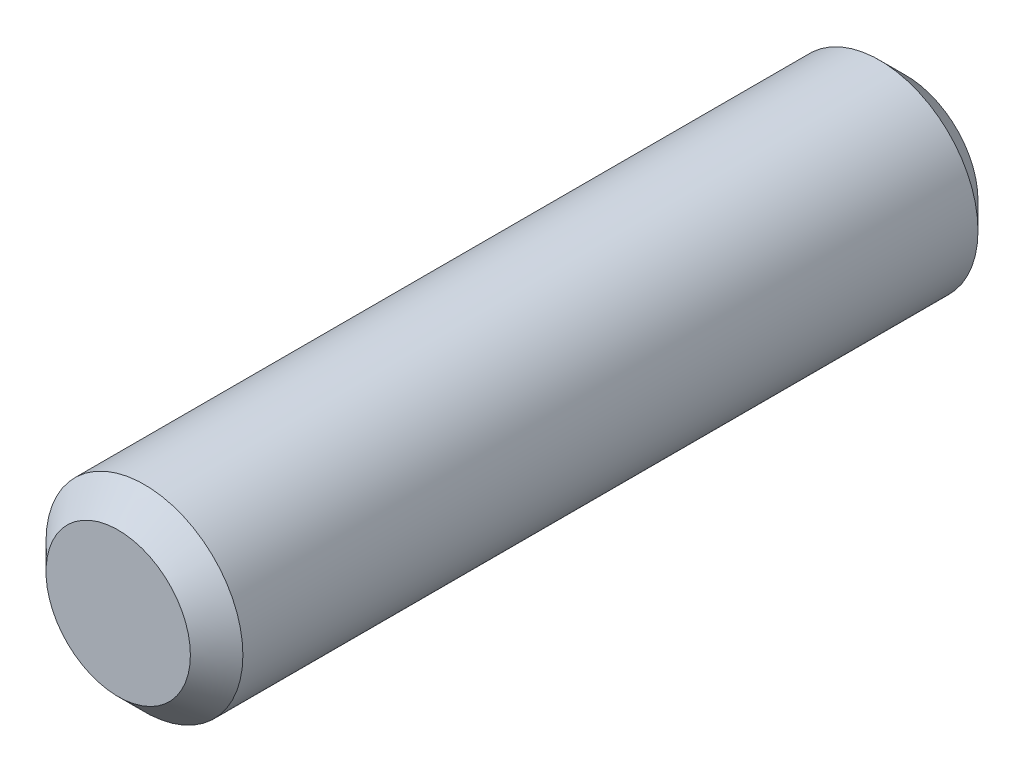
ISO-10303-21;
HEADER;
FILE_DESCRIPTION(('STEP AP214'),'2;1');
FILE_NAME('part.step','',(''),(''),'','','');
FILE_SCHEMA(('AUTOMOTIVE_DESIGN { 1 0 10303 214 1 1 1 1 }'));
ENDSEC;
DATA;
#1=APPLICATION_CONTEXT('core data for automotive mechanical design processes');
#2=APPLICATION_PROTOCOL_DEFINITION('international standard','automotive_design',2000,#1);
#3=PRODUCT_CONTEXT('',#1,'mechanical');
#4=PRODUCT('Part','Part','',(#3));
#5=PRODUCT_RELATED_PRODUCT_CATEGORY('part','',(#4));
#6=PRODUCT_DEFINITION_FORMATION('','',#4);
#7=PRODUCT_DEFINITION_CONTEXT('part definition',#1,'design');
#8=PRODUCT_DEFINITION('design','',#6,#7);
#9=PRODUCT_DEFINITION_SHAPE('','',#8);
#10=(LENGTH_UNIT() NAMED_UNIT(*) SI_UNIT(.MILLI.,.METRE.));
#11=(NAMED_UNIT(*) PLANE_ANGLE_UNIT() SI_UNIT($,.RADIAN.));
#12=(NAMED_UNIT(*) SI_UNIT($,.STERADIAN.) SOLID_ANGLE_UNIT());
#13=UNCERTAINTY_MEASURE_WITH_UNIT(LENGTH_MEASURE(1.E-05),#10,'distance_accuracy_value','');
#14=(GEOMETRIC_REPRESENTATION_CONTEXT(3) GLOBAL_UNCERTAINTY_ASSIGNED_CONTEXT((#13)) GLOBAL_UNIT_ASSIGNED_CONTEXT((#10,
#11,#12)) REPRESENTATION_CONTEXT('',''));
#15=CARTESIAN_POINT('',(0.,0.,0.));
#16=DIRECTION('',(0.,0.,1.));
#17=DIRECTION('',(1.,0.,0.));
#18=AXIS2_PLACEMENT_3D('',#15,#16,#17);
#19=CARTESIAN_POINT('',(0.,0.,30.));
#20=DIRECTION('',(0.,0.,-1.));
#21=DIRECTION('',(-1.,0.,0.));
#22=AXIS2_PLACEMENT_3D('',#19,#20,#21);
#23=CYLINDRICAL_SURFACE('',#22,7.5);
#24=CARTESIAN_POINT('',(0.,0.,28.));
#25=DIRECTION('',(0.,0.,1.));
#26=DIRECTION('',(1.,0.,0.));
#27=AXIS2_PLACEMENT_3D('',#24,#25,#26);
#28=CIRCLE('',#27,7.5);
#29=CARTESIAN_POINT('',(7.5,0.,28.));
#30=VERTEX_POINT('',#29);
#31=EDGE_CURVE('E34',#30,#30,#28,.F.);
#32=ORIENTED_EDGE('',*,*,#31,.T.);
#33=EDGE_LOOP('',(#32));
#34=FACE_BOUND('',#33,.T.);
#35=CARTESIAN_POINT('',(0.,0.,-28.));
#36=DIRECTION('',(0.,0.,1.));
#37=DIRECTION('',(1.,0.,0.));
#38=AXIS2_PLACEMENT_3D('',#35,#36,#37);
#39=CIRCLE('',#38,7.5);
#40=CARTESIAN_POINT('',(7.5,0.,-28.));
#41=VERTEX_POINT('',#40);
#42=EDGE_CURVE('E38',#41,#41,#39,.T.);
#43=ORIENTED_EDGE('',*,*,#42,.T.);
#44=EDGE_LOOP('',(#43));
#45=FACE_BOUND('',#44,.T.);
#46=ADVANCED_FACE('F28',(#34,#45),#23,.T.);
#47=CARTESIAN_POINT('',(0.,0.,30.));
#48=DIRECTION('',(0.,0.,1.));
#49=DIRECTION('',(1.,0.,0.));
#50=AXIS2_PLACEMENT_3D('',#47,#48,#49);
#51=PLANE('',#50);
#52=CARTESIAN_POINT('',(0.,0.,30.));
#53=DIRECTION('',(0.,0.,1.));
#54=DIRECTION('',(1.,0.,0.));
#55=AXIS2_PLACEMENT_3D('',#52,#53,#54);
#56=CIRCLE('',#55,5.49999999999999);
#57=CARTESIAN_POINT('',(5.49999999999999,0.,30.));
#58=VERTEX_POINT('',#57);
#59=EDGE_CURVE('E42',#58,#58,#56,.T.);
#60=ORIENTED_EDGE('',*,*,#59,.T.);
#61=EDGE_LOOP('',(#60));
#62=FACE_BOUND('',#61,.T.);
#63=ADVANCED_FACE('F48',(#62),#51,.T.);
#64=CARTESIAN_POINT('',(0.,0.,-30.));
#65=DIRECTION('',(0.,0.,1.));
#66=DIRECTION('',(1.,0.,0.));
#67=AXIS2_PLACEMENT_3D('',#64,#65,#66);
#68=PLANE('',#67);
#69=CARTESIAN_POINT('',(0.,0.,-30.));
#70=DIRECTION('',(0.,0.,1.));
#71=DIRECTION('',(1.,0.,0.));
#72=AXIS2_PLACEMENT_3D('',#69,#70,#71);
#73=CIRCLE('',#72,5.49999999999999);
#74=CARTESIAN_POINT('',(5.49999999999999,0.,-30.));
#75=VERTEX_POINT('',#74);
#76=EDGE_CURVE('E10',#75,#75,#73,.F.);
#77=ORIENTED_EDGE('',*,*,#76,.T.);
#78=EDGE_LOOP('',(#77));
#79=FACE_BOUND('',#78,.T.);
#80=ADVANCED_FACE('F53',(#79),#68,.F.);
#81=CARTESIAN_POINT('',(0.,0.,30.));
#82=DIRECTION('',(0.,0.,-1.));
#83=DIRECTION('',(-1.,0.,0.));
#84=AXIS2_PLACEMENT_3D('',#81,#82,#83);
#85=CONICAL_SURFACE('',#84,5.49999999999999,0.785398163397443);
#86=ORIENTED_EDGE('',*,*,#31,.F.);
#87=EDGE_LOOP('',(#86));
#88=FACE_BOUND('',#87,.T.);
#89=ORIENTED_EDGE('',*,*,#59,.F.);
#90=EDGE_LOOP('',(#89));
#91=FACE_BOUND('',#90,.T.);
#92=ADVANCED_FACE('F50',(#88,#91),#85,.T.);
#93=CARTESIAN_POINT('',(0.,0.,-28.));
#94=DIRECTION('',(0.,0.,1.));
#95=DIRECTION('',(1.,0.,0.));
#96=AXIS2_PLACEMENT_3D('',#93,#94,#95);
#97=CONICAL_SURFACE('',#96,7.5,0.785398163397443);
#98=ORIENTED_EDGE('',*,*,#76,.F.);
#99=EDGE_LOOP('',(#98));
#100=FACE_BOUND('',#99,.T.);
#101=ORIENTED_EDGE('',*,*,#42,.F.);
#102=EDGE_LOOP('',(#101));
#103=FACE_BOUND('',#102,.T.);
#104=ADVANCED_FACE('F52',(#100,#103),#97,.T.);
#105=CLOSED_SHELL('',(#46,#63,#80,#92,#104));
#106=MANIFOLD_SOLID_BREP('B2',#105);
#107=ADVANCED_BREP_SHAPE_REPRESENTATION('',(#18,#106),#14);
#108=SHAPE_DEFINITION_REPRESENTATION(#9,#107);
ENDSEC;
END-ISO-10303-21;
